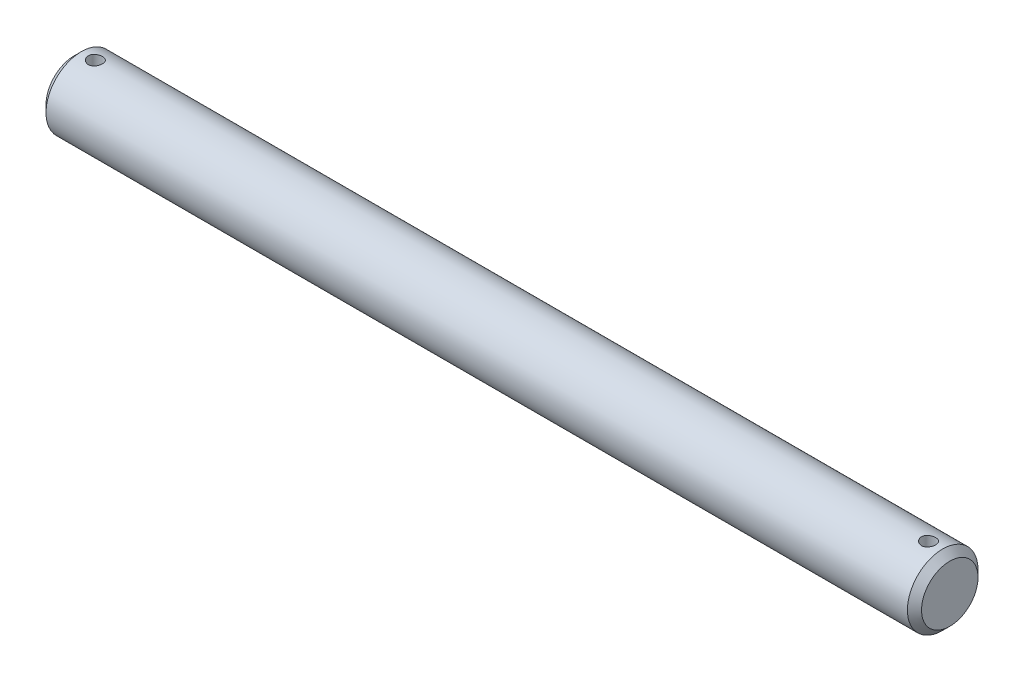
from build123d import *

# Parameters (mm, degrees)
CROQUIS1_R                 = 50
SALIENTE_EXTRUIR1_DEPTH    = 1240
CORTAR_EXTRUIR1_DEPTH      = 1243.014492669
CORTAR_EXTRUIR1_DEPTH_BACK = 1243.014492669
CROQUIS2_R                 = 10
CHAFL_N1_SIZE              = 10


with BuildPart() as part:
    # Croquis1 → Saliente-Extruir1 (new body)
    with BuildSketch(Plane(origin=(0, 0, 0), x_dir=(0, 0, -1), z_dir=(1, 0, 0))):
        Circle(CROQUIS1_R)
    extrude(amount=SALIENTE_EXTRUIR1_DEPTH)

    # Croquis2 → Cortar-Extruir1 (cut, two sides: drawn at the far end of the back side and taken through both)
    with BuildSketch(Plane(origin=(0, 0, 0), x_dir=(1, 0, 0), z_dir=(0, 1, 0)).offset(-CORTAR_EXTRUIR1_DEPTH_BACK)):
        with Locations(Location((30, 0, 0), (0, 0, 270))):
            Circle(CROQUIS2_R)
        with Locations(Location((1210, 0, 0), (0, 0, 270))):
            Circle(CROQUIS2_R)
    extrude(amount=CORTAR_EXTRUIR1_DEPTH + CORTAR_EXTRUIR1_DEPTH_BACK, mode=Mode.SUBTRACT)

    # Chafl_n1
    chafl_n1_edges = [part.edges().sort_by_distance(p)[0] for p in [
        (0, 0, 50),
        (1240, 0, 50),
    ]]
    chamfer(chafl_n1_edges, length=CHAFL_N1_SIZE)


solid = part.part
